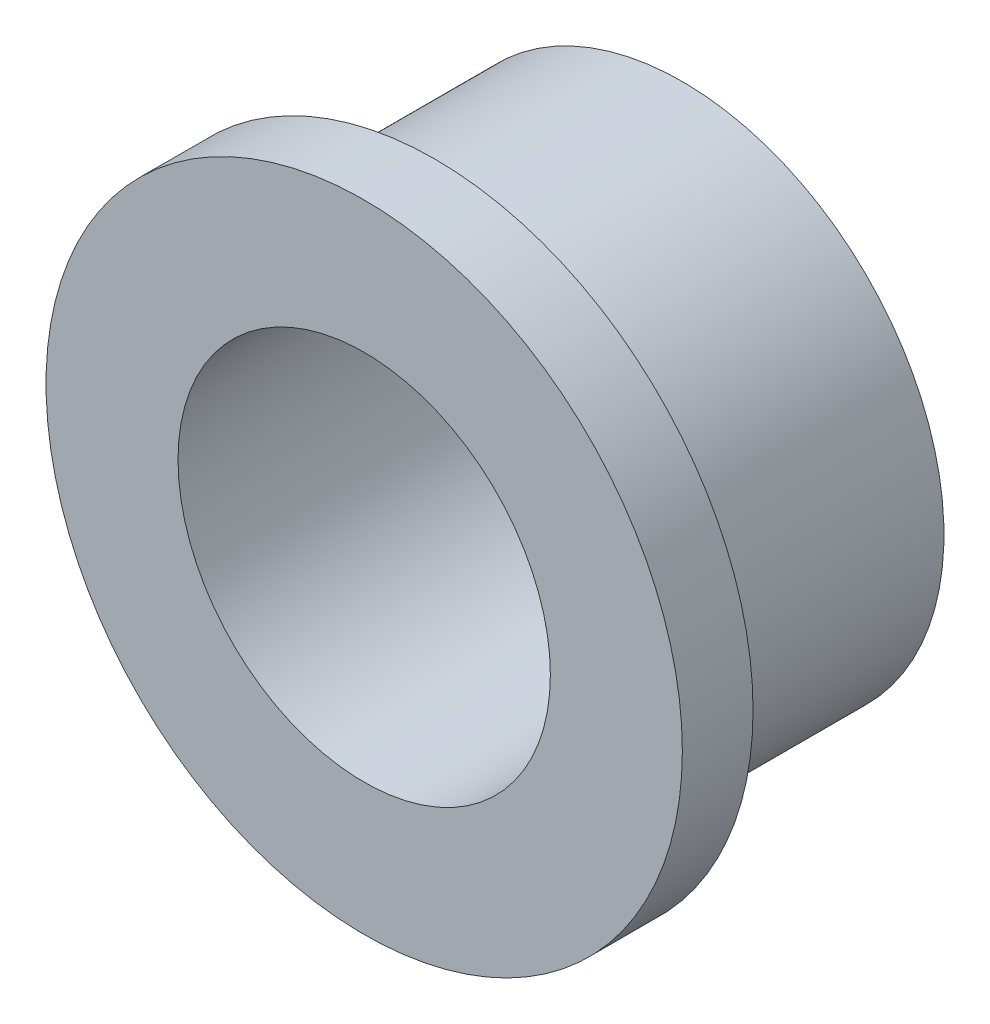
ISO-10303-21;
HEADER;
FILE_DESCRIPTION(('STEP AP214'),'2;1');
FILE_NAME('part.step','',(''),(''),'','','');
FILE_SCHEMA(('AUTOMOTIVE_DESIGN { 1 0 10303 214 1 1 1 1 }'));
ENDSEC;
DATA;
#1=APPLICATION_CONTEXT('core data for automotive mechanical design processes');
#2=APPLICATION_PROTOCOL_DEFINITION('international standard','automotive_design',2000,#1);
#3=PRODUCT_CONTEXT('',#1,'mechanical');
#4=PRODUCT('Part','Part','',(#3));
#5=PRODUCT_RELATED_PRODUCT_CATEGORY('part','',(#4));
#6=PRODUCT_DEFINITION_FORMATION('','',#4);
#7=PRODUCT_DEFINITION_CONTEXT('part definition',#1,'design');
#8=PRODUCT_DEFINITION('design','',#6,#7);
#9=PRODUCT_DEFINITION_SHAPE('','',#8);
#10=(LENGTH_UNIT() NAMED_UNIT(*) SI_UNIT(.MILLI.,.METRE.));
#11=(NAMED_UNIT(*) PLANE_ANGLE_UNIT() SI_UNIT($,.RADIAN.));
#12=(NAMED_UNIT(*) SI_UNIT($,.STERADIAN.) SOLID_ANGLE_UNIT());
#13=UNCERTAINTY_MEASURE_WITH_UNIT(LENGTH_MEASURE(1.E-05),#10,'distance_accuracy_value','');
#14=(GEOMETRIC_REPRESENTATION_CONTEXT(3) GLOBAL_UNCERTAINTY_ASSIGNED_CONTEXT((#13)) GLOBAL_UNIT_ASSIGNED_CONTEXT((#10,
#11,#12)) REPRESENTATION_CONTEXT('',''));
#15=CARTESIAN_POINT('',(0.,0.,0.));
#16=DIRECTION('',(0.,0.,1.));
#17=DIRECTION('',(1.,0.,0.));
#18=AXIS2_PLACEMENT_3D('',#15,#16,#17);
#19=CARTESIAN_POINT('',(0.,0.,-13.5));
#20=DIRECTION('',(0.,0.,1.));
#21=DIRECTION('',(1.,0.,0.));
#22=AXIS2_PLACEMENT_3D('',#19,#20,#21);
#23=CYLINDRICAL_SURFACE('',#22,13.5);
#24=CARTESIAN_POINT('',(0.,0.,0.));
#25=DIRECTION('',(0.,0.,1.));
#26=DIRECTION('',(1.,0.,0.));
#27=AXIS2_PLACEMENT_3D('',#24,#25,#26);
#28=CIRCLE('',#27,13.5);
#29=CARTESIAN_POINT('',(13.5,0.,0.));
#30=VERTEX_POINT('',#29);
#31=EDGE_CURVE('E44',#30,#30,#28,.T.);
#32=ORIENTED_EDGE('',*,*,#31,.F.);
#33=EDGE_LOOP('',(#32));
#34=FACE_BOUND('',#33,.T.);
#35=CARTESIAN_POINT('',(0.,0.,-3.));
#36=DIRECTION('',(0.,0.,-1.));
#37=DIRECTION('',(-1.,0.,0.));
#38=AXIS2_PLACEMENT_3D('',#35,#36,#37);
#39=CIRCLE('',#38,13.5);
#40=CARTESIAN_POINT('',(-13.5,0.,-3.));
#41=VERTEX_POINT('',#40);
#42=EDGE_CURVE('E51',#41,#41,#39,.F.);
#43=ORIENTED_EDGE('',*,*,#42,.T.);
#44=EDGE_LOOP('',(#43));
#45=FACE_BOUND('',#44,.T.);
#46=ADVANCED_FACE('F33',(#34,#45),#23,.T.);
#47=CARTESIAN_POINT('',(0.,0.,-13.5));
#48=DIRECTION('',(0.,0.,1.));
#49=DIRECTION('',(1.,0.,0.));
#50=AXIS2_PLACEMENT_3D('',#47,#48,#49);
#51=PLANE('',#50);
#52=CARTESIAN_POINT('',(0.,0.,-13.5));
#53=DIRECTION('',(0.,0.,1.));
#54=DIRECTION('',(1.,0.,0.));
#55=AXIS2_PLACEMENT_3D('',#52,#53,#54);
#56=CIRCLE('',#55,8.90000000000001);
#57=CARTESIAN_POINT('',(8.90000000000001,0.,-13.5));
#58=VERTEX_POINT('',#57);
#59=EDGE_CURVE('E40',#58,#58,#56,.T.);
#60=ORIENTED_EDGE('',*,*,#59,.T.);
#61=EDGE_LOOP('',(#60));
#62=FACE_BOUND('',#61,.T.);
#63=CARTESIAN_POINT('',(0.,0.,-13.5));
#64=DIRECTION('',(0.,0.,-1.));
#65=DIRECTION('',(-1.,0.,0.));
#66=AXIS2_PLACEMENT_3D('',#63,#64,#65);
#67=CIRCLE('',#66,11.1);
#68=CARTESIAN_POINT('',(-11.1,0.,-13.5));
#69=VERTEX_POINT('',#68);
#70=EDGE_CURVE('E57',#69,#69,#67,.T.);
#71=ORIENTED_EDGE('',*,*,#70,.T.);
#72=EDGE_LOOP('',(#71));
#73=FACE_BOUND('',#72,.T.);
#74=ADVANCED_FACE('F80',(#62,#73),#51,.F.);
#75=CARTESIAN_POINT('',(0.,0.,0.));
#76=DIRECTION('',(0.,0.,1.));
#77=DIRECTION('',(1.,0.,0.));
#78=AXIS2_PLACEMENT_3D('',#75,#76,#77);
#79=PLANE('',#78);
#80=CARTESIAN_POINT('',(0.,0.,0.));
#81=DIRECTION('',(0.,0.,1.));
#82=DIRECTION('',(1.,0.,0.));
#83=AXIS2_PLACEMENT_3D('',#80,#81,#82);
#84=CIRCLE('',#83,7.9);
#85=CARTESIAN_POINT('',(7.9,0.,0.));
#86=VERTEX_POINT('',#85);
#87=EDGE_CURVE('E48',#86,#86,#84,.T.);
#88=ORIENTED_EDGE('',*,*,#87,.F.);
#89=EDGE_LOOP('',(#88));
#90=FACE_BOUND('',#89,.T.);
#91=ORIENTED_EDGE('',*,*,#31,.T.);
#92=EDGE_LOOP('',(#91));
#93=FACE_BOUND('',#92,.T.);
#94=ADVANCED_FACE('F76',(#90,#93),#79,.T.);
#95=CARTESIAN_POINT('',(0.,0.,-13.5));
#96=DIRECTION('',(0.,0.,1.));
#97=DIRECTION('',(1.,0.,0.));
#98=AXIS2_PLACEMENT_3D('',#95,#96,#97);
#99=CYLINDRICAL_SURFACE('',#98,7.9);
#100=CARTESIAN_POINT('',(0.,0.,-12.5));
#101=DIRECTION('',(0.,0.,1.));
#102=DIRECTION('',(1.,0.,0.));
#103=AXIS2_PLACEMENT_3D('',#100,#101,#102);
#104=CIRCLE('',#103,7.9);
#105=CARTESIAN_POINT('',(7.9,0.,-12.5));
#106=VERTEX_POINT('',#105);
#107=EDGE_CURVE('E11',#106,#106,#104,.F.);
#108=ORIENTED_EDGE('',*,*,#107,.T.);
#109=EDGE_LOOP('',(#108));
#110=FACE_BOUND('',#109,.T.);
#111=ORIENTED_EDGE('',*,*,#87,.T.);
#112=EDGE_LOOP('',(#111));
#113=FACE_BOUND('',#112,.T.);
#114=ADVANCED_FACE('F68',(#110,#113),#99,.F.);
#115=CARTESIAN_POINT('',(0.,0.,-3.));
#116=DIRECTION('',(0.,0.,-1.));
#117=DIRECTION('',(-1.,0.,0.));
#118=AXIS2_PLACEMENT_3D('',#115,#116,#117);
#119=PLANE('',#118);
#120=ORIENTED_EDGE('',*,*,#42,.F.);
#121=EDGE_LOOP('',(#120));
#122=FACE_BOUND('',#121,.T.);
#123=CARTESIAN_POINT('',(0.,0.,-3.));
#124=DIRECTION('',(0.,0.,-1.));
#125=DIRECTION('',(-1.,0.,0.));
#126=AXIS2_PLACEMENT_3D('',#123,#124,#125);
#127=CIRCLE('',#126,11.1);
#128=CARTESIAN_POINT('',(-11.1,0.,-3.));
#129=VERTEX_POINT('',#128);
#130=EDGE_CURVE('E53',#129,#129,#127,.T.);
#131=ORIENTED_EDGE('',*,*,#130,.F.);
#132=EDGE_LOOP('',(#131));
#133=FACE_BOUND('',#132,.T.);
#134=ADVANCED_FACE('F66',(#122,#133),#119,.T.);
#135=CARTESIAN_POINT('',(0.,0.,-3.));
#136=DIRECTION('',(0.,0.,-1.));
#137=DIRECTION('',(-1.,0.,0.));
#138=AXIS2_PLACEMENT_3D('',#135,#136,#137);
#139=CYLINDRICAL_SURFACE('',#138,11.1);
#140=CARTESIAN_POINT('',(-11.1,0.,-3.));
#141=CARTESIAN_POINT('',(-11.1,0.,-3.109375));
#142=CARTESIAN_POINT('',(-11.1,0.,-3.21875));
#143=CARTESIAN_POINT('',(-11.1,0.,-3.4375));
#144=CARTESIAN_POINT('',(-11.1,0.,-3.546875));
#145=CARTESIAN_POINT('',(-11.1,0.,-3.765625));
#146=CARTESIAN_POINT('',(-11.1,0.,-3.875));
#147=CARTESIAN_POINT('',(-11.1,0.,-4.09375));
#148=CARTESIAN_POINT('',(-11.1,0.,-4.203125));
#149=CARTESIAN_POINT('',(-11.1,0.,-4.421875));
#150=CARTESIAN_POINT('',(-11.1,0.,-4.53125));
#151=CARTESIAN_POINT('',(-11.1,0.,-4.75));
#152=CARTESIAN_POINT('',(-11.1,0.,-4.859375));
#153=CARTESIAN_POINT('',(-11.1,0.,-5.078125));
#154=CARTESIAN_POINT('',(-11.1,0.,-5.1875));
#155=CARTESIAN_POINT('',(-11.1,0.,-5.40625));
#156=CARTESIAN_POINT('',(-11.1,0.,-5.515625));
#157=CARTESIAN_POINT('',(-11.1,0.,-5.734375));
#158=CARTESIAN_POINT('',(-11.1,0.,-5.84375));
#159=CARTESIAN_POINT('',(-11.1,0.,-6.0625));
#160=CARTESIAN_POINT('',(-11.1,0.,-6.171875));
#161=CARTESIAN_POINT('',(-11.1,0.,-6.390625));
#162=CARTESIAN_POINT('',(-11.1,0.,-6.5));
#163=CARTESIAN_POINT('',(-11.1,0.,-6.71875));
#164=CARTESIAN_POINT('',(-11.1,0.,-6.828125));
#165=CARTESIAN_POINT('',(-11.1,0.,-7.046875));
#166=CARTESIAN_POINT('',(-11.1,0.,-7.15625));
#167=CARTESIAN_POINT('',(-11.1,0.,-7.375));
#168=CARTESIAN_POINT('',(-11.1,0.,-7.484375));
#169=CARTESIAN_POINT('',(-11.1,0.,-7.703125));
#170=CARTESIAN_POINT('',(-11.1,0.,-7.8125));
#171=CARTESIAN_POINT('',(-11.1,0.,-8.03125));
#172=CARTESIAN_POINT('',(-11.1,0.,-8.140625));
#173=CARTESIAN_POINT('',(-11.1,0.,-8.359375));
#174=CARTESIAN_POINT('',(-11.1,0.,-8.46875));
#175=CARTESIAN_POINT('',(-11.1,0.,-8.6875));
#176=CARTESIAN_POINT('',(-11.1,0.,-8.796875));
#177=CARTESIAN_POINT('',(-11.1,0.,-9.015625));
#178=CARTESIAN_POINT('',(-11.1,0.,-9.125));
#179=CARTESIAN_POINT('',(-11.1,0.,-9.34375));
#180=CARTESIAN_POINT('',(-11.1,0.,-9.453125));
#181=CARTESIAN_POINT('',(-11.1,0.,-9.671875));
#182=CARTESIAN_POINT('',(-11.1,0.,-9.78125));
#183=CARTESIAN_POINT('',(-11.1,0.,-10.));
#184=CARTESIAN_POINT('',(-11.1,0.,-10.109375));
#185=CARTESIAN_POINT('',(-11.1,0.,-10.328125));
#186=CARTESIAN_POINT('',(-11.1,0.,-10.4375));
#187=CARTESIAN_POINT('',(-11.1,0.,-10.65625));
#188=CARTESIAN_POINT('',(-11.1,0.,-10.765625));
#189=CARTESIAN_POINT('',(-11.1,0.,-10.984375));
#190=CARTESIAN_POINT('',(-11.1,0.,-11.09375));
#191=CARTESIAN_POINT('',(-11.1,0.,-11.3125));
#192=CARTESIAN_POINT('',(-11.1,0.,-11.421875));
#193=CARTESIAN_POINT('',(-11.1,0.,-11.640625));
#194=CARTESIAN_POINT('',(-11.1,0.,-11.75));
#195=CARTESIAN_POINT('',(-11.1,0.,-11.96875));
#196=CARTESIAN_POINT('',(-11.1,0.,-12.078125));
#197=CARTESIAN_POINT('',(-11.1,0.,-12.296875));
#198=CARTESIAN_POINT('',(-11.1,0.,-12.40625));
#199=CARTESIAN_POINT('',(-11.1,0.,-12.625));
#200=CARTESIAN_POINT('',(-11.1,0.,-12.734375));
#201=CARTESIAN_POINT('',(-11.1,0.,-12.953125));
#202=CARTESIAN_POINT('',(-11.1,0.,-13.0625));
#203=CARTESIAN_POINT('',(-11.1,0.,-13.28125));
#204=CARTESIAN_POINT('',(-11.1,0.,-13.390625));
#205=CARTESIAN_POINT('',(-11.1,0.,-13.5));
#206=B_SPLINE_CURVE_WITH_KNOTS('',3,(#140,#141,#142,#143,#144,#145,#146,#147,#148,#149,#150,
#151,#152,#153,#154,#155,#156,#157,#158,#159,#160,#161,#162,#163,#164,#165,#166,#167,#168,#169,
#170,#171,#172,#173,#174,#175,#176,#177,#178,#179,#180,#181,#182,#183,#184,#185,#186,#187,#188,
#189,#190,#191,#192,#193,#194,#195,#196,#197,#198,#199,#200,#201,#202,#203,#204,#205),
.UNSPECIFIED.,.F.,.F.,(4,2,2,2,2,2,2,2,2,2,2,2,2,2,2,2,2,2,2,2,2,2,2,2,2,2,2,2,2,2,2,2,4),(0.,
0.328125,0.65625,0.984375,1.3125,1.640625,1.96875,2.296875,2.625,2.953125,3.28125,3.609375,
3.9375,4.265625,4.59375,4.921875,5.25,5.578125,5.90625,6.234375,6.5625,6.890625,7.21875,
7.546875,7.875,8.203125,8.53125,8.859375,9.1875,9.515625,9.84375,10.171875,10.5),.UNSPECIFIED.);
#207=EDGE_CURVE('BSEAM63',#129,#69,#206,.T.);
#208=ORIENTED_EDGE('',*,*,#130,.T.);
#209=ORIENTED_EDGE('',*,*,#70,.F.);
#210=ORIENTED_EDGE('',*,*,#207,.T.);
#211=ORIENTED_EDGE('',*,*,#207,.F.);
#212=EDGE_LOOP('',(#208,#210,#209,#211));
#213=FACE_BOUND('',#212,.T.);
#214=ADVANCED_FACE('F63',(#213),#139,.T.);
#215=CARTESIAN_POINT('',(0.,0.,-13.5));
#216=DIRECTION('',(0.,0.,-1.));
#217=DIRECTION('',(-1.,0.,0.));
#218=AXIS2_PLACEMENT_3D('',#215,#216,#217);
#219=CONICAL_SURFACE('',#218,8.90000000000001,0.785398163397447);
#220=ORIENTED_EDGE('',*,*,#107,.F.);
#221=EDGE_LOOP('',(#220));
#222=FACE_BOUND('',#221,.T.);
#223=ORIENTED_EDGE('',*,*,#59,.F.);
#224=EDGE_LOOP('',(#223));
#225=FACE_BOUND('',#224,.T.);
#226=ADVANCED_FACE('F35',(#222,#225),#219,.F.);
#227=CLOSED_SHELL('',(#46,#74,#94,#114,#134,#214,#226));
#228=MANIFOLD_SOLID_BREP('B2',#227);
#229=ADVANCED_BREP_SHAPE_REPRESENTATION('',(#18,#228),#14);
#230=SHAPE_DEFINITION_REPRESENTATION(#9,#229);
ENDSEC;
END-ISO-10303-21;
